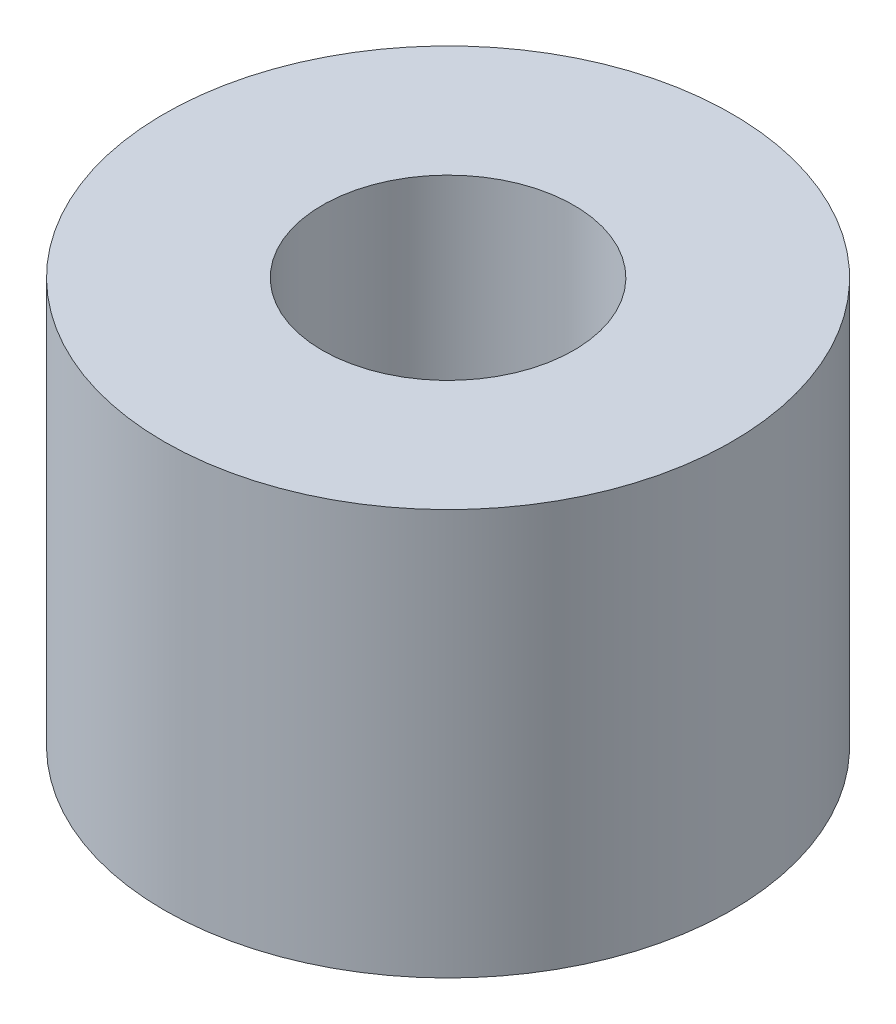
ISO-10303-21;
HEADER;
FILE_DESCRIPTION(('STEP AP214'),'2;1');
FILE_NAME('part.step','',(''),(''),'','','');
FILE_SCHEMA(('AUTOMOTIVE_DESIGN { 1 0 10303 214 1 1 1 1 }'));
ENDSEC;
DATA;
#1=APPLICATION_CONTEXT('core data for automotive mechanical design processes');
#2=APPLICATION_PROTOCOL_DEFINITION('international standard','automotive_design',2000,#1);
#3=PRODUCT_CONTEXT('',#1,'mechanical');
#4=PRODUCT('Part','Part','',(#3));
#5=PRODUCT_RELATED_PRODUCT_CATEGORY('part','',(#4));
#6=PRODUCT_DEFINITION_FORMATION('','',#4);
#7=PRODUCT_DEFINITION_CONTEXT('part definition',#1,'design');
#8=PRODUCT_DEFINITION('design','',#6,#7);
#9=PRODUCT_DEFINITION_SHAPE('','',#8);
#10=(LENGTH_UNIT() NAMED_UNIT(*) SI_UNIT(.MILLI.,.METRE.));
#11=(NAMED_UNIT(*) PLANE_ANGLE_UNIT() SI_UNIT($,.RADIAN.));
#12=(NAMED_UNIT(*) SI_UNIT($,.STERADIAN.) SOLID_ANGLE_UNIT());
#13=UNCERTAINTY_MEASURE_WITH_UNIT(LENGTH_MEASURE(1.E-05),#10,'distance_accuracy_value','');
#14=(GEOMETRIC_REPRESENTATION_CONTEXT(3) GLOBAL_UNCERTAINTY_ASSIGNED_CONTEXT((#13)) GLOBAL_UNIT_ASSIGNED_CONTEXT((#10,
#11,#12)) REPRESENTATION_CONTEXT('',''));
#15=CARTESIAN_POINT('',(0.,0.,0.));
#16=DIRECTION('',(0.,0.,1.));
#17=DIRECTION('',(1.,0.,0.));
#18=AXIS2_PLACEMENT_3D('',#15,#16,#17);
#19=CARTESIAN_POINT('',(0.,5.,0.));
#20=DIRECTION('',(0.,1.,0.));
#21=DIRECTION('',(0.,0.,1.));
#22=AXIS2_PLACEMENT_3D('',#19,#20,#21);
#23=PLANE('',#22);
#24=CARTESIAN_POINT('',(0.,5.,0.));
#25=DIRECTION('',(0.,1.,0.));
#26=DIRECTION('',(0.,0.,1.));
#27=AXIS2_PLACEMENT_3D('',#24,#25,#26);
#28=CIRCLE('',#27,3.5);
#29=CARTESIAN_POINT('',(0.,5.,3.5));
#30=VERTEX_POINT('',#29);
#31=EDGE_CURVE('E10',#30,#30,#28,.T.);
#32=ORIENTED_EDGE('',*,*,#31,.T.);
#33=EDGE_LOOP('',(#32));
#34=FACE_BOUND('',#33,.T.);
#35=CARTESIAN_POINT('',(0.,5.,0.));
#36=DIRECTION('',(0.,1.,0.));
#37=DIRECTION('',(0.,0.,1.));
#38=AXIS2_PLACEMENT_3D('',#35,#36,#37);
#39=CIRCLE('',#38,1.55);
#40=CARTESIAN_POINT('',(0.,5.,1.55));
#41=VERTEX_POINT('',#40);
#42=EDGE_CURVE('E42',#41,#41,#39,.T.);
#43=ORIENTED_EDGE('',*,*,#42,.F.);
#44=EDGE_LOOP('',(#43));
#45=FACE_BOUND('',#44,.T.);
#46=ADVANCED_FACE('F31',(#34,#45),#23,.T.);
#47=CARTESIAN_POINT('',(0.,0.,0.));
#48=DIRECTION('',(0.,1.,0.));
#49=DIRECTION('',(0.,0.,1.));
#50=AXIS2_PLACEMENT_3D('',#47,#48,#49);
#51=PLANE('',#50);
#52=CARTESIAN_POINT('',(0.,0.,0.));
#53=DIRECTION('',(0.,1.,0.));
#54=DIRECTION('',(0.,0.,1.));
#55=AXIS2_PLACEMENT_3D('',#52,#53,#54);
#56=CIRCLE('',#55,3.5);
#57=CARTESIAN_POINT('',(0.,0.,3.5));
#58=VERTEX_POINT('',#57);
#59=EDGE_CURVE('E35',#58,#58,#56,.T.);
#60=ORIENTED_EDGE('',*,*,#59,.F.);
#61=EDGE_LOOP('',(#60));
#62=FACE_BOUND('',#61,.T.);
#63=CARTESIAN_POINT('',(0.,0.,0.));
#64=DIRECTION('',(0.,1.,0.));
#65=DIRECTION('',(0.,0.,1.));
#66=AXIS2_PLACEMENT_3D('',#63,#64,#65);
#67=CIRCLE('',#66,1.55);
#68=CARTESIAN_POINT('',(0.,0.,1.55));
#69=VERTEX_POINT('',#68);
#70=EDGE_CURVE('E44',#69,#69,#67,.T.);
#71=ORIENTED_EDGE('',*,*,#70,.T.);
#72=EDGE_LOOP('',(#71));
#73=FACE_BOUND('',#72,.T.);
#74=ADVANCED_FACE('F54',(#62,#73),#51,.F.);
#75=CARTESIAN_POINT('',(0.,5.,0.));
#76=DIRECTION('',(0.,-1.,0.));
#77=DIRECTION('',(0.,0.,-1.));
#78=AXIS2_PLACEMENT_3D('',#75,#76,#77);
#79=CYLINDRICAL_SURFACE('',#78,3.5);
#80=ORIENTED_EDGE('',*,*,#31,.F.);
#81=EDGE_LOOP('',(#80));
#82=FACE_BOUND('',#81,.T.);
#83=ORIENTED_EDGE('',*,*,#59,.T.);
#84=EDGE_LOOP('',(#83));
#85=FACE_BOUND('',#84,.T.);
#86=ADVANCED_FACE('F33',(#82,#85),#79,.T.);
#87=CARTESIAN_POINT('',(0.,5.,0.));
#88=DIRECTION('',(0.,-1.,0.));
#89=DIRECTION('',(0.,0.,-1.));
#90=AXIS2_PLACEMENT_3D('',#87,#88,#89);
#91=CYLINDRICAL_SURFACE('',#90,1.55);
#92=ORIENTED_EDGE('',*,*,#42,.T.);
#93=EDGE_LOOP('',(#92));
#94=FACE_BOUND('',#93,.T.);
#95=ORIENTED_EDGE('',*,*,#70,.F.);
#96=EDGE_LOOP('',(#95));
#97=FACE_BOUND('',#96,.T.);
#98=ADVANCED_FACE('F50',(#94,#97),#91,.F.);
#99=CLOSED_SHELL('',(#46,#74,#86,#98));
#100=MANIFOLD_SOLID_BREP('B2',#99);
#101=ADVANCED_BREP_SHAPE_REPRESENTATION('',(#18,#100),#14);
#102=SHAPE_DEFINITION_REPRESENTATION(#9,#101);
ENDSEC;
END-ISO-10303-21;
